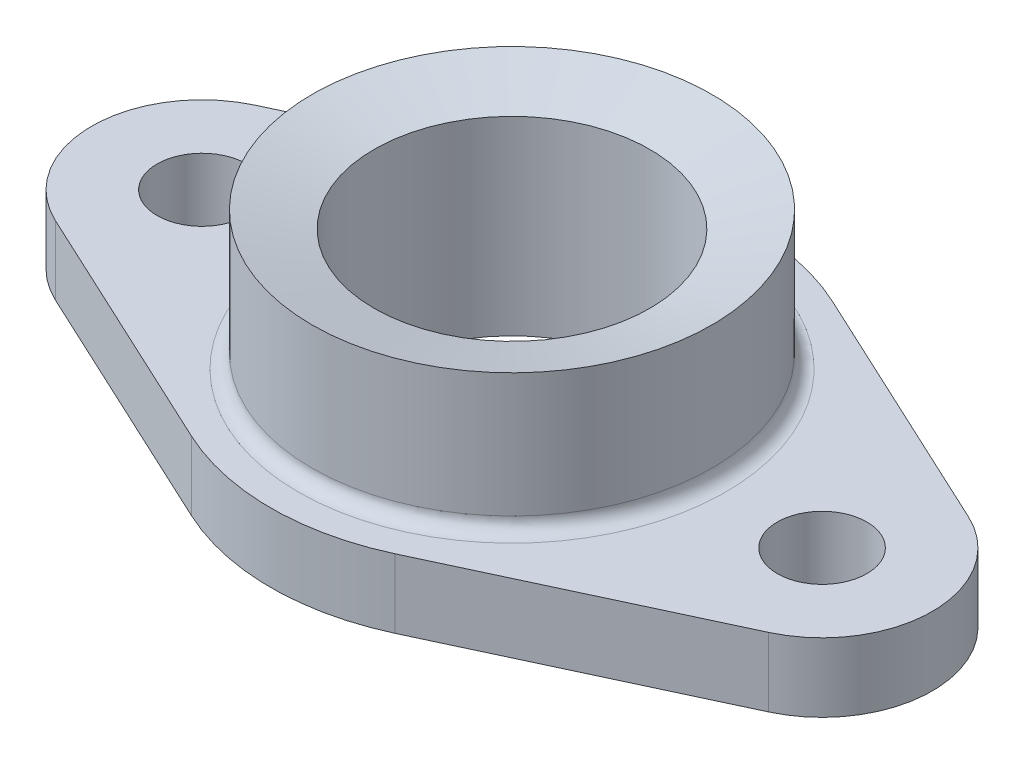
ISO-10303-21;
HEADER;
FILE_DESCRIPTION(('STEP AP214'),'2;1');
FILE_NAME('part.step','',(''),(''),'','','');
FILE_SCHEMA(('AUTOMOTIVE_DESIGN { 1 0 10303 214 1 1 1 1 }'));
ENDSEC;
DATA;
#1=APPLICATION_CONTEXT('core data for automotive mechanical design processes');
#2=APPLICATION_PROTOCOL_DEFINITION('international standard','automotive_design',2000,#1);
#3=PRODUCT_CONTEXT('',#1,'mechanical');
#4=PRODUCT('Part','Part','',(#3));
#5=PRODUCT_RELATED_PRODUCT_CATEGORY('part','',(#4));
#6=PRODUCT_DEFINITION_FORMATION('','',#4);
#7=PRODUCT_DEFINITION_CONTEXT('part definition',#1,'design');
#8=PRODUCT_DEFINITION('design','',#6,#7);
#9=PRODUCT_DEFINITION_SHAPE('','',#8);
#10=(LENGTH_UNIT() NAMED_UNIT(*) SI_UNIT(.MILLI.,.METRE.));
#11=(NAMED_UNIT(*) PLANE_ANGLE_UNIT() SI_UNIT($,.RADIAN.));
#12=(NAMED_UNIT(*) SI_UNIT($,.STERADIAN.) SOLID_ANGLE_UNIT());
#13=UNCERTAINTY_MEASURE_WITH_UNIT(LENGTH_MEASURE(1.E-05),#10,'distance_accuracy_value','');
#14=(GEOMETRIC_REPRESENTATION_CONTEXT(3) GLOBAL_UNCERTAINTY_ASSIGNED_CONTEXT((#13)) GLOBAL_UNIT_ASSIGNED_CONTEXT((#10,
#11,#12)) REPRESENTATION_CONTEXT('',''));
#15=CARTESIAN_POINT('',(0.,0.,0.));
#16=DIRECTION('',(0.,0.,1.));
#17=DIRECTION('',(1.,0.,0.));
#18=AXIS2_PLACEMENT_3D('',#15,#16,#17);
#19=CARTESIAN_POINT('',(-45.,0.,0.));
#20=DIRECTION('',(0.,1.,0.));
#21=DIRECTION('',(0.,0.,1.));
#22=AXIS2_PLACEMENT_3D('',#19,#20,#21);
#23=PLANE('',#22);
#24=CARTESIAN_POINT('',(45.,0.,0.));
#25=DIRECTION('',(0.,1.,0.));
#26=DIRECTION('',(0.,0.,1.));
#27=AXIS2_PLACEMENT_3D('',#24,#25,#26);
#28=CIRCLE('',#27,6.5);
#29=CARTESIAN_POINT('',(45.,0.,6.5));
#30=VERTEX_POINT('',#29);
#31=EDGE_CURVE('E164',#30,#30,#28,.T.);
#32=ORIENTED_EDGE('',*,*,#31,.T.);
#33=EDGE_LOOP('',(#32));
#34=FACE_BOUND('',#33,.T.);
#35=CARTESIAN_POINT('',(-45.,0.,0.));
#36=DIRECTION('',(0.,1.,0.));
#37=DIRECTION('',(0.,0.,1.));
#38=AXIS2_PLACEMENT_3D('',#35,#36,#37);
#39=CIRCLE('',#38,16.);
#40=CARTESIAN_POINT('',(-51.7555555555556,0.,-14.5038777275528));
#41=VERTEX_POINT('',#40);
#42=CARTESIAN_POINT('',(-51.7555555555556,0.,14.5038777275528));
#43=VERTEX_POINT('',#42);
#44=EDGE_CURVE('E129',#41,#43,#39,.T.);
#45=ORIENTED_EDGE('',*,*,#44,.F.);
#46=DIRECTION('',(-0.906492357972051,0.,0.422222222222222));
#47=VECTOR('',#46,1.);
#48=CARTESIAN_POINT('',(-51.7555555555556,0.,-14.5038777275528));
#49=LINE('',#48,#47);
#50=CARTESIAN_POINT('',(-14.7777777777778,0.,-31.7272325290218));
#51=VERTEX_POINT('',#50);
#52=EDGE_CURVE('E82',#51,#41,#49,.T.);
#53=ORIENTED_EDGE('',*,*,#52,.F.);
#54=CARTESIAN_POINT('',(0.,0.,0.));
#55=DIRECTION('',(0.,1.,0.));
#56=DIRECTION('',(0.,0.,1.));
#57=AXIS2_PLACEMENT_3D('',#54,#55,#56);
#58=CIRCLE('',#57,35.);
#59=CARTESIAN_POINT('',(14.7777777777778,0.,-31.7272325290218));
#60=VERTEX_POINT('',#59);
#61=EDGE_CURVE('E76',#60,#51,#58,.T.);
#62=ORIENTED_EDGE('',*,*,#61,.F.);
#63=DIRECTION('',(-0.906492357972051,0.,-0.422222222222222));
#64=VECTOR('',#63,1.);
#65=CARTESIAN_POINT('',(14.7777777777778,0.,-31.7272325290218));
#66=LINE('',#65,#64);
#67=CARTESIAN_POINT('',(51.7555555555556,0.,-14.5038777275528));
#68=VERTEX_POINT('',#67);
#69=EDGE_CURVE('E119',#68,#60,#66,.T.);
#70=ORIENTED_EDGE('',*,*,#69,.F.);
#71=CARTESIAN_POINT('',(45.,0.,0.));
#72=DIRECTION('',(0.,1.,0.));
#73=DIRECTION('',(0.,0.,1.));
#74=AXIS2_PLACEMENT_3D('',#71,#72,#73);
#75=CIRCLE('',#74,16.);
#76=CARTESIAN_POINT('',(51.7555555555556,0.,14.5038777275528));
#77=VERTEX_POINT('',#76);
#78=EDGE_CURVE('E139',#77,#68,#75,.T.);
#79=ORIENTED_EDGE('',*,*,#78,.F.);
#80=DIRECTION('',(0.906492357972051,0.,-0.422222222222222));
#81=VECTOR('',#80,1.);
#82=CARTESIAN_POINT('',(51.7555555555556,0.,14.5038777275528));
#83=LINE('',#82,#81);
#84=CARTESIAN_POINT('',(14.7777777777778,0.,31.7272325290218));
#85=VERTEX_POINT('',#84);
#86=EDGE_CURVE('E137',#85,#77,#83,.T.);
#87=ORIENTED_EDGE('',*,*,#86,.F.);
#88=CARTESIAN_POINT('',(0.,0.,0.));
#89=DIRECTION('',(0.,1.,0.));
#90=DIRECTION('',(0.,0.,1.));
#91=AXIS2_PLACEMENT_3D('',#88,#89,#90);
#92=CIRCLE('',#91,35.);
#93=CARTESIAN_POINT('',(-14.7777777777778,0.,31.7272325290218));
#94=VERTEX_POINT('',#93);
#95=EDGE_CURVE('E135',#94,#85,#92,.T.);
#96=ORIENTED_EDGE('',*,*,#95,.F.);
#97=DIRECTION('',(0.90649235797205,0.,0.422222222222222));
#98=VECTOR('',#97,1.);
#99=CARTESIAN_POINT('',(-14.7777777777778,0.,31.7272325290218));
#100=LINE('',#99,#98);
#101=EDGE_CURVE('E132',#43,#94,#100,.T.);
#102=ORIENTED_EDGE('',*,*,#101,.F.);
#103=EDGE_LOOP('',(#45,#53,#62,#70,#79,#87,#96,#102));
#104=FACE_BOUND('',#103,.T.);
#105=CARTESIAN_POINT('',(0.,0.,0.));
#106=DIRECTION('',(0.,1.,0.));
#107=DIRECTION('',(0.,0.,1.));
#108=AXIS2_PLACEMENT_3D('',#105,#106,#107);
#109=CIRCLE('',#108,20.);
#110=CARTESIAN_POINT('',(0.,0.,20.));
#111=VERTEX_POINT('',#110);
#112=EDGE_CURVE('E163',#111,#111,#109,.T.);
#113=ORIENTED_EDGE('',*,*,#112,.T.);
#114=EDGE_LOOP('',(#113));
#115=FACE_BOUND('',#114,.T.);
#116=CARTESIAN_POINT('',(-45.,0.,0.));
#117=DIRECTION('',(0.,1.,0.));
#118=DIRECTION('',(0.,0.,1.));
#119=AXIS2_PLACEMENT_3D('',#116,#117,#118);
#120=CIRCLE('',#119,6.5);
#121=CARTESIAN_POINT('',(-45.,0.,6.5));
#122=VERTEX_POINT('',#121);
#123=EDGE_CURVE('E168',#122,#122,#120,.T.);
#124=ORIENTED_EDGE('',*,*,#123,.T.);
#125=EDGE_LOOP('',(#124));
#126=FACE_BOUND('',#125,.T.);
#127=ADVANCED_FACE('F30',(#34,#104,#115,#126),#23,.F.);
#128=CARTESIAN_POINT('',(-45.,10.,0.));
#129=DIRECTION('',(0.,1.,0.));
#130=DIRECTION('',(0.,0.,1.));
#131=AXIS2_PLACEMENT_3D('',#128,#129,#130);
#132=PLANE('',#131);
#133=CARTESIAN_POINT('',(0.,10.,0.));
#134=DIRECTION('',(0.,1.,0.));
#135=DIRECTION('',(0.,0.,1.));
#136=AXIS2_PLACEMENT_3D('',#133,#134,#135);
#137=CIRCLE('',#136,31.);
#138=CARTESIAN_POINT('',(0.,10.,31.));
#139=VERTEX_POINT('',#138);
#140=EDGE_CURVE('E39',#139,#139,#137,.F.);
#141=ORIENTED_EDGE('',*,*,#140,.T.);
#142=EDGE_LOOP('',(#141));
#143=FACE_BOUND('',#142,.T.);
#144=CARTESIAN_POINT('',(45.,10.,0.));
#145=DIRECTION('',(0.,1.,0.));
#146=DIRECTION('',(0.,0.,1.));
#147=AXIS2_PLACEMENT_3D('',#144,#145,#146);
#148=CIRCLE('',#147,6.5);
#149=CARTESIAN_POINT('',(45.,10.,6.5));
#150=VERTEX_POINT('',#149);
#151=EDGE_CURVE('E160',#150,#150,#148,.F.);
#152=ORIENTED_EDGE('',*,*,#151,.T.);
#153=EDGE_LOOP('',(#152));
#154=FACE_BOUND('',#153,.T.);
#155=CARTESIAN_POINT('',(-45.,10.,0.));
#156=DIRECTION('',(0.,1.,0.));
#157=DIRECTION('',(0.,0.,1.));
#158=AXIS2_PLACEMENT_3D('',#155,#156,#157);
#159=CIRCLE('',#158,16.);
#160=CARTESIAN_POINT('',(-51.7555555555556,10.,-14.5038777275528));
#161=VERTEX_POINT('',#160);
#162=CARTESIAN_POINT('',(-51.7555555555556,10.,14.5038777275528));
#163=VERTEX_POINT('',#162);
#164=EDGE_CURVE('E144',#161,#163,#159,.T.);
#165=ORIENTED_EDGE('',*,*,#164,.T.);
#166=DIRECTION('',(0.90649235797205,0.,0.422222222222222));
#167=VECTOR('',#166,1.);
#168=CARTESIAN_POINT('',(-14.7777777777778,10.,31.7272325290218));
#169=LINE('',#168,#167);
#170=CARTESIAN_POINT('',(-14.7777777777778,10.,31.7272325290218));
#171=VERTEX_POINT('',#170);
#172=EDGE_CURVE('E91',#163,#171,#169,.T.);
#173=ORIENTED_EDGE('',*,*,#172,.T.);
#174=CARTESIAN_POINT('',(0.,10.,0.));
#175=DIRECTION('',(0.,1.,0.));
#176=DIRECTION('',(0.,0.,1.));
#177=AXIS2_PLACEMENT_3D('',#174,#175,#176);
#178=CIRCLE('',#177,35.);
#179=CARTESIAN_POINT('',(14.7777777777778,10.,31.7272325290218));
#180=VERTEX_POINT('',#179);
#181=EDGE_CURVE('E231',#171,#180,#178,.T.);
#182=ORIENTED_EDGE('',*,*,#181,.T.);
#183=DIRECTION('',(0.906492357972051,0.,-0.422222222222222));
#184=VECTOR('',#183,1.);
#185=CARTESIAN_POINT('',(51.7555555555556,10.,14.5038777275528));
#186=LINE('',#185,#184);
#187=CARTESIAN_POINT('',(51.7555555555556,10.,14.5038777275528));
#188=VERTEX_POINT('',#187);
#189=EDGE_CURVE('E233',#180,#188,#186,.T.);
#190=ORIENTED_EDGE('',*,*,#189,.T.);
#191=CARTESIAN_POINT('',(45.,10.,0.));
#192=DIRECTION('',(0.,1.,0.));
#193=DIRECTION('',(0.,0.,1.));
#194=AXIS2_PLACEMENT_3D('',#191,#192,#193);
#195=CIRCLE('',#194,16.);
#196=CARTESIAN_POINT('',(51.7555555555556,10.,-14.5038777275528));
#197=VERTEX_POINT('',#196);
#198=EDGE_CURVE('E111',#188,#197,#195,.T.);
#199=ORIENTED_EDGE('',*,*,#198,.T.);
#200=DIRECTION('',(-0.906492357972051,0.,-0.422222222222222));
#201=VECTOR('',#200,1.);
#202=CARTESIAN_POINT('',(14.7777777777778,10.,-31.7272325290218));
#203=LINE('',#202,#201);
#204=CARTESIAN_POINT('',(14.7777777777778,10.,-31.7272325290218));
#205=VERTEX_POINT('',#204);
#206=EDGE_CURVE('E104',#197,#205,#203,.T.);
#207=ORIENTED_EDGE('',*,*,#206,.T.);
#208=CARTESIAN_POINT('',(0.,10.,0.));
#209=DIRECTION('',(0.,1.,0.));
#210=DIRECTION('',(0.,0.,1.));
#211=AXIS2_PLACEMENT_3D('',#208,#209,#210);
#212=CIRCLE('',#211,35.);
#213=CARTESIAN_POINT('',(-14.7777777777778,10.,-31.7272325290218));
#214=VERTEX_POINT('',#213);
#215=EDGE_CURVE('E109',#205,#214,#212,.T.);
#216=ORIENTED_EDGE('',*,*,#215,.T.);
#217=DIRECTION('',(-0.906492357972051,0.,0.422222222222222));
#218=VECTOR('',#217,1.);
#219=CARTESIAN_POINT('',(-51.7555555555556,10.,-14.5038777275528));
#220=LINE('',#219,#218);
#221=EDGE_CURVE('E47',#214,#161,#220,.T.);
#222=ORIENTED_EDGE('',*,*,#221,.T.);
#223=EDGE_LOOP('',(#165,#173,#182,#190,#199,#207,#216,#222));
#224=FACE_BOUND('',#223,.T.);
#225=CARTESIAN_POINT('',(-45.,10.,0.));
#226=DIRECTION('',(0.,1.,0.));
#227=DIRECTION('',(0.,0.,1.));
#228=AXIS2_PLACEMENT_3D('',#225,#226,#227);
#229=CIRCLE('',#228,6.5);
#230=CARTESIAN_POINT('',(-45.,10.,6.5));
#231=VERTEX_POINT('',#230);
#232=EDGE_CURVE('E165',#231,#231,#229,.F.);
#233=ORIENTED_EDGE('',*,*,#232,.T.);
#234=EDGE_LOOP('',(#233));
#235=FACE_BOUND('',#234,.T.);
#236=ADVANCED_FACE('F106',(#143,#154,#224,#235),#132,.T.);
#237=CARTESIAN_POINT('',(-45.,10.,0.));
#238=DIRECTION('',(0.,-1.,0.));
#239=DIRECTION('',(0.,0.,-1.));
#240=AXIS2_PLACEMENT_3D('',#237,#238,#239);
#241=CYLINDRICAL_SURFACE('',#240,16.);
#242=ORIENTED_EDGE('',*,*,#44,.T.);
#243=DIRECTION('',(0.,-1.,0.));
#244=VECTOR('',#243,1.);
#245=CARTESIAN_POINT('',(-51.7555555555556,10.,14.5038777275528));
#246=LINE('',#245,#244);
#247=EDGE_CURVE('E157',#163,#43,#246,.T.);
#248=ORIENTED_EDGE('',*,*,#247,.F.);
#249=ORIENTED_EDGE('',*,*,#164,.F.);
#250=DIRECTION('',(0.,-1.,0.));
#251=VECTOR('',#250,1.);
#252=CARTESIAN_POINT('',(-51.7555555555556,10.,-14.5038777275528));
#253=LINE('',#252,#251);
#254=EDGE_CURVE('E125',#161,#41,#253,.T.);
#255=ORIENTED_EDGE('',*,*,#254,.T.);
#256=EDGE_LOOP('',(#242,#248,#249,#255));
#257=FACE_BOUND('',#256,.T.);
#258=ADVANCED_FACE('F190',(#257),#241,.T.);
#259=CARTESIAN_POINT('',(-14.7777777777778,10.,31.7272325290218));
#260=DIRECTION('',(0.422222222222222,0.,-0.906492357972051));
#261=DIRECTION('',(-0.906492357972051,0.,-0.422222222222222));
#262=AXIS2_PLACEMENT_3D('',#259,#260,#261);
#263=PLANE('',#262);
#264=ORIENTED_EDGE('',*,*,#101,.T.);
#265=DIRECTION('',(0.,-1.,0.));
#266=VECTOR('',#265,1.);
#267=CARTESIAN_POINT('',(-14.7777777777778,10.,31.7272325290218));
#268=LINE('',#267,#266);
#269=EDGE_CURVE('E154',#171,#94,#268,.T.);
#270=ORIENTED_EDGE('',*,*,#269,.F.);
#271=ORIENTED_EDGE('',*,*,#172,.F.);
#272=ORIENTED_EDGE('',*,*,#247,.T.);
#273=EDGE_LOOP('',(#264,#270,#271,#272));
#274=FACE_BOUND('',#273,.T.);
#275=ADVANCED_FACE('F215',(#274),#263,.F.);
#276=CARTESIAN_POINT('',(0.,10.,0.));
#277=DIRECTION('',(0.,-1.,0.));
#278=DIRECTION('',(0.,0.,-1.));
#279=AXIS2_PLACEMENT_3D('',#276,#277,#278);
#280=CYLINDRICAL_SURFACE('',#279,35.);
#281=ORIENTED_EDGE('',*,*,#95,.T.);
#282=DIRECTION('',(0.,-1.,0.));
#283=VECTOR('',#282,1.);
#284=CARTESIAN_POINT('',(14.7777777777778,10.,31.7272325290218));
#285=LINE('',#284,#283);
#286=EDGE_CURVE('E151',#180,#85,#285,.T.);
#287=ORIENTED_EDGE('',*,*,#286,.F.);
#288=ORIENTED_EDGE('',*,*,#181,.F.);
#289=ORIENTED_EDGE('',*,*,#269,.T.);
#290=EDGE_LOOP('',(#281,#287,#288,#289));
#291=FACE_BOUND('',#290,.T.);
#292=ADVANCED_FACE('F211',(#291),#280,.T.);
#293=CARTESIAN_POINT('',(51.7555555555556,10.,14.5038777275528));
#294=DIRECTION('',(-0.422222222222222,0.,-0.906492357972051));
#295=DIRECTION('',(-0.906492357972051,0.,0.422222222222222));
#296=AXIS2_PLACEMENT_3D('',#293,#294,#295);
#297=PLANE('',#296);
#298=ORIENTED_EDGE('',*,*,#86,.T.);
#299=DIRECTION('',(0.,-1.,0.));
#300=VECTOR('',#299,1.);
#301=CARTESIAN_POINT('',(51.7555555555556,10.,14.5038777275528));
#302=LINE('',#301,#300);
#303=EDGE_CURVE('E148',#188,#77,#302,.T.);
#304=ORIENTED_EDGE('',*,*,#303,.F.);
#305=ORIENTED_EDGE('',*,*,#189,.F.);
#306=ORIENTED_EDGE('',*,*,#286,.T.);
#307=EDGE_LOOP('',(#298,#304,#305,#306));
#308=FACE_BOUND('',#307,.T.);
#309=ADVANCED_FACE('F207',(#308),#297,.F.);
#310=CARTESIAN_POINT('',(45.,10.,0.));
#311=DIRECTION('',(0.,-1.,0.));
#312=DIRECTION('',(0.,0.,-1.));
#313=AXIS2_PLACEMENT_3D('',#310,#311,#312);
#314=CYLINDRICAL_SURFACE('',#313,16.);
#315=ORIENTED_EDGE('',*,*,#78,.T.);
#316=DIRECTION('',(0.,-1.,0.));
#317=VECTOR('',#316,1.);
#318=CARTESIAN_POINT('',(51.7555555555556,10.,-14.5038777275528));
#319=LINE('',#318,#317);
#320=EDGE_CURVE('E120',#197,#68,#319,.T.);
#321=ORIENTED_EDGE('',*,*,#320,.F.);
#322=ORIENTED_EDGE('',*,*,#198,.F.);
#323=ORIENTED_EDGE('',*,*,#303,.T.);
#324=EDGE_LOOP('',(#315,#321,#322,#323));
#325=FACE_BOUND('',#324,.T.);
#326=ADVANCED_FACE('F204',(#325),#314,.T.);
#327=CARTESIAN_POINT('',(14.7777777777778,10.,-31.7272325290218));
#328=DIRECTION('',(-0.422222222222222,0.,0.906492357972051));
#329=DIRECTION('',(0.906492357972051,0.,0.422222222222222));
#330=AXIS2_PLACEMENT_3D('',#327,#328,#329);
#331=PLANE('',#330);
#332=ORIENTED_EDGE('',*,*,#69,.T.);
#333=DIRECTION('',(0.,-1.,0.));
#334=VECTOR('',#333,1.);
#335=CARTESIAN_POINT('',(14.7777777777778,10.,-31.7272325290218));
#336=LINE('',#335,#334);
#337=EDGE_CURVE('E116',#205,#60,#336,.T.);
#338=ORIENTED_EDGE('',*,*,#337,.F.);
#339=ORIENTED_EDGE('',*,*,#206,.F.);
#340=ORIENTED_EDGE('',*,*,#320,.T.);
#341=EDGE_LOOP('',(#332,#338,#339,#340));
#342=FACE_BOUND('',#341,.T.);
#343=ADVANCED_FACE('F117',(#342),#331,.F.);
#344=CARTESIAN_POINT('',(0.,10.,0.));
#345=DIRECTION('',(0.,-1.,0.));
#346=DIRECTION('',(0.,0.,-1.));
#347=AXIS2_PLACEMENT_3D('',#344,#345,#346);
#348=CYLINDRICAL_SURFACE('',#347,35.);
#349=ORIENTED_EDGE('',*,*,#61,.T.);
#350=DIRECTION('',(0.,-1.,0.));
#351=VECTOR('',#350,1.);
#352=CARTESIAN_POINT('',(-14.7777777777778,10.,-31.7272325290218));
#353=LINE('',#352,#351);
#354=EDGE_CURVE('E121',#214,#51,#353,.T.);
#355=ORIENTED_EDGE('',*,*,#354,.F.);
#356=ORIENTED_EDGE('',*,*,#215,.F.);
#357=ORIENTED_EDGE('',*,*,#337,.T.);
#358=EDGE_LOOP('',(#349,#355,#356,#357));
#359=FACE_BOUND('',#358,.T.);
#360=ADVANCED_FACE('F123',(#359),#348,.T.);
#361=CARTESIAN_POINT('',(-51.7555555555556,10.,-14.5038777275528));
#362=DIRECTION('',(0.422222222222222,0.,0.906492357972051));
#363=DIRECTION('',(0.906492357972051,0.,-0.422222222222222));
#364=AXIS2_PLACEMENT_3D('',#361,#362,#363);
#365=PLANE('',#364);
#366=ORIENTED_EDGE('',*,*,#52,.T.);
#367=ORIENTED_EDGE('',*,*,#254,.F.);
#368=ORIENTED_EDGE('',*,*,#221,.F.);
#369=ORIENTED_EDGE('',*,*,#354,.T.);
#370=EDGE_LOOP('',(#366,#367,#368,#369));
#371=FACE_BOUND('',#370,.T.);
#372=ADVANCED_FACE('F196',(#371),#365,.F.);
#373=CARTESIAN_POINT('',(0.,30.,0.));
#374=DIRECTION('',(0.,-1.,0.));
#375=DIRECTION('',(0.,0.,-1.));
#376=AXIS2_PLACEMENT_3D('',#373,#374,#375);
#377=CYLINDRICAL_SURFACE('',#376,29.);
#378=CARTESIAN_POINT('',(0.,12.,0.));
#379=DIRECTION('',(0.,1.,0.));
#380=DIRECTION('',(0.,0.,1.));
#381=AXIS2_PLACEMENT_3D('',#378,#379,#380);
#382=CIRCLE('',#381,29.);
#383=CARTESIAN_POINT('',(0.,12.,29.));
#384=VERTEX_POINT('',#383);
#385=EDGE_CURVE('E11',#384,#384,#382,.T.);
#386=ORIENTED_EDGE('',*,*,#385,.T.);
#387=EDGE_LOOP('',(#386));
#388=FACE_BOUND('',#387,.T.);
#389=CARTESIAN_POINT('',(0.,30.,0.));
#390=DIRECTION('',(0.,1.,0.));
#391=DIRECTION('',(0.,0.,1.));
#392=AXIS2_PLACEMENT_3D('',#389,#390,#391);
#393=CIRCLE('',#392,29.);
#394=CARTESIAN_POINT('',(0.,30.,29.));
#395=VERTEX_POINT('',#394);
#396=EDGE_CURVE('E133',#395,#395,#393,.T.);
#397=ORIENTED_EDGE('',*,*,#396,.F.);
#398=EDGE_LOOP('',(#397));
#399=FACE_BOUND('',#398,.T.);
#400=ADVANCED_FACE('F199',(#388,#399),#377,.T.);
#401=CARTESIAN_POINT('',(0.,30.,0.));
#402=DIRECTION('',(0.,-1.,0.));
#403=DIRECTION('',(0.,0.,-1.));
#404=AXIS2_PLACEMENT_3D('',#401,#402,#403);
#405=CYLINDRICAL_SURFACE('',#404,20.);
#406=CARTESIAN_POINT('',(0.,27.5884572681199,0.));
#407=DIRECTION('',(0.,1.,0.));
#408=DIRECTION('',(0.,0.,1.));
#409=AXIS2_PLACEMENT_3D('',#406,#407,#408);
#410=CIRCLE('',#409,20.);
#411=CARTESIAN_POINT('',(0.,27.5884572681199,20.));
#412=VERTEX_POINT('',#411);
#413=EDGE_CURVE('E159',#412,#412,#410,.T.);
#414=ORIENTED_EDGE('',*,*,#413,.T.);
#415=EDGE_LOOP('',(#414));
#416=FACE_BOUND('',#415,.T.);
#417=ORIENTED_EDGE('',*,*,#112,.F.);
#418=EDGE_LOOP('',(#417));
#419=FACE_BOUND('',#418,.T.);
#420=ADVANCED_FACE('F255',(#416,#419),#405,.F.);
#421=CARTESIAN_POINT('',(45.,30.,0.));
#422=DIRECTION('',(0.,-1.,0.));
#423=DIRECTION('',(0.,0.,-1.));
#424=AXIS2_PLACEMENT_3D('',#421,#422,#423);
#425=CYLINDRICAL_SURFACE('',#424,6.5);
#426=ORIENTED_EDGE('',*,*,#151,.F.);
#427=EDGE_LOOP('',(#426));
#428=FACE_BOUND('',#427,.T.);
#429=ORIENTED_EDGE('',*,*,#31,.F.);
#430=EDGE_LOOP('',(#429));
#431=FACE_BOUND('',#430,.T.);
#432=ADVANCED_FACE('F249',(#428,#431),#425,.F.);
#433=CARTESIAN_POINT('',(-45.,30.,0.));
#434=DIRECTION('',(0.,-1.,0.));
#435=DIRECTION('',(0.,0.,-1.));
#436=AXIS2_PLACEMENT_3D('',#433,#434,#435);
#437=CYLINDRICAL_SURFACE('',#436,6.5);
#438=ORIENTED_EDGE('',*,*,#232,.F.);
#439=EDGE_LOOP('',(#438));
#440=FACE_BOUND('',#439,.T.);
#441=ORIENTED_EDGE('',*,*,#123,.F.);
#442=EDGE_LOOP('',(#441));
#443=FACE_BOUND('',#442,.T.);
#444=ADVANCED_FACE('F181',(#440,#443),#437,.F.);
#445=CARTESIAN_POINT('',(0.,27.5884572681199,0.));
#446=DIRECTION('',(0.,1.,0.));
#447=DIRECTION('',(0.,0.,1.));
#448=AXIS2_PLACEMENT_3D('',#445,#446,#447);
#449=CONICAL_SURFACE('',#448,20.,1.30899693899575);
#450=ORIENTED_EDGE('',*,*,#396,.T.);
#451=EDGE_LOOP('',(#450));
#452=FACE_BOUND('',#451,.T.);
#453=ORIENTED_EDGE('',*,*,#413,.F.);
#454=EDGE_LOOP('',(#453));
#455=FACE_BOUND('',#454,.T.);
#456=ADVANCED_FACE('F176',(#452,#455),#449,.F.);
#457=CARTESIAN_POINT('',(0.,12.,0.));
#458=DIRECTION('',(0.,1.,0.));
#459=DIRECTION('',(0.,0.,1.));
#460=AXIS2_PLACEMENT_3D('',#457,#458,#459);
#461=TOROIDAL_SURFACE('',#460,31.,2.);
#462=ORIENTED_EDGE('',*,*,#385,.F.);
#463=EDGE_LOOP('',(#462));
#464=FACE_BOUND('',#463,.T.);
#465=ORIENTED_EDGE('',*,*,#140,.F.);
#466=EDGE_LOOP('',(#465));
#467=FACE_BOUND('',#466,.T.);
#468=ADVANCED_FACE('F32',(#464,#467),#461,.F.);
#469=CLOSED_SHELL('',(#127,#236,#258,#275,#292,#309,#326,#343,#360,#372,#400,#420,#432,#444,
#456,#468));
#470=MANIFOLD_SOLID_BREP('B2',#469);
#471=ADVANCED_BREP_SHAPE_REPRESENTATION('',(#18,#470),#14);
#472=SHAPE_DEFINITION_REPRESENTATION(#9,#471);
ENDSEC;
END-ISO-10303-21;
